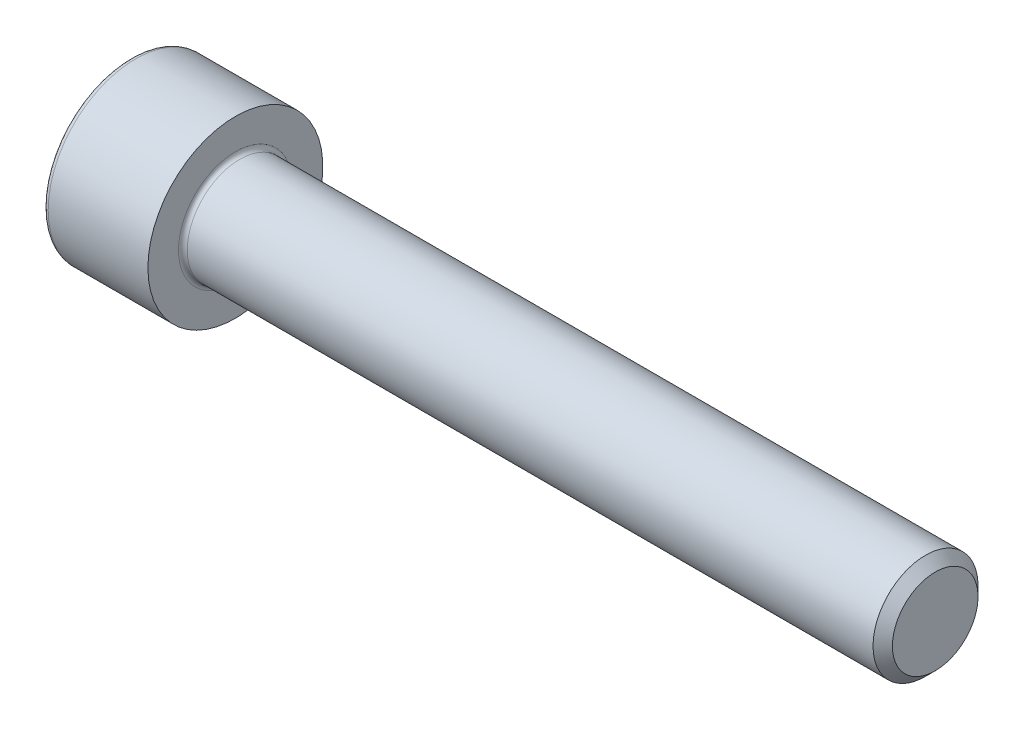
from build123d import *

# Parameters (mm, degrees)
FILLET1_R   = 0.25
FILLET2_R   = 0.3
HEX_2_DEPTH = 3


with BuildPart() as part:
    # BodySke → Base-Revolve (revolve)
    with BuildSketch(Plane.XY, mode=Mode.PRIVATE) as base_revolve_sk:
        Polygon((0, 0), (0, 5), (6, 5), (6, 3), (45.4455, 3), (46, 2.4455), (46, 0), align=None)
    revolve(base_revolve_sk.sketch.rotate(Axis((-31.75, 0, 0), (1, 0, 0)), 90), axis=Axis((-31.75, 0, 0), (1, 0, 0)))

    # Fillet1
    fillet1_edges = [part.edges().sort_by_distance(p)[0] for p in [
        (6, 0, -3),
    ]]
    fillet(fillet1_edges, radius=FILLET1_R)

    # Fillet2
    fillet2_edges = [part.edges().sort_by_distance(p)[0] for p in [
        (0, 0, -5),
    ]]
    fillet(fillet2_edges, radius=FILLET2_R)

    # Sketch2 → Hex-PreBroach (revolve, cut)
    with BuildSketch(Plane.XY, mode=Mode.PRIVATE) as hex_prebroach_sk:
        Polygon((0, 2.542), (3, 2.542), (4.467624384, 0), (0, 0), align=None)
    revolve(hex_prebroach_sk.sketch.rotate(Axis((0, 0, 0), (1, 0, 0)), 90), axis=Axis((0, 0, 0), (1, 0, 0)), mode=Mode.SUBTRACT)

    # Sketch3 → Hex 2 (cut)
    with BuildSketch(Plane(origin=(0, 0, 0), x_dir=(0, 0.500000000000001, 0.866025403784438), z_dir=(-1, 0, 0))):
        Polygon((1.467624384, 2.542), (-1.467624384, 2.542), (-2.935248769, 0), (-1.467624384, -2.542), (1.467624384, -2.542), (2.935248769, 0), align=None)
    extrude(amount=-HEX_2_DEPTH, mode=Mode.SUBTRACT)


solid = part.part
